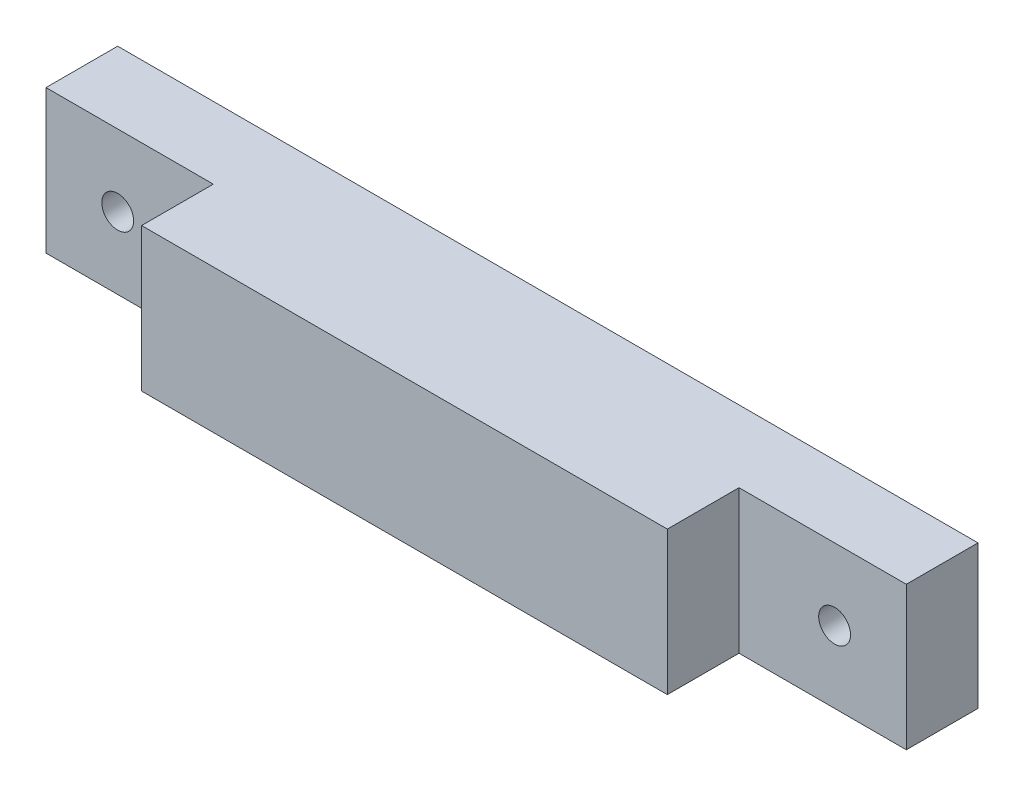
from build123d import *

# Parameters (mm, degrees)
ESQUISSE1_W             = 54
ESQUISSE1_H             = 9
EXTRUSION1_DEPTH        = 9
ESQUISSE3_W             = 10.5
ESQUISSE3_H             = 9
ENL_V_MAT_EXTRU_1_DEPTH = 4.5
ESQUISSE5_W             = 10.5
ESQUISSE5_H             = 9
ENL_V_MAT_EXTRU_2_DEPTH = 4.5
ESQUISSE6_R             = 1
ENL_V_MAT_EXTRU_4_DEPTH = 4.5
ESQUISSE7_R             = 1
ENL_V_MAT_EXTRU_5_DEPTH = 4.5


with BuildPart() as part:
    # Esquisse1 → Extrusion1 (new body)
    with BuildSketch(Plane.XY):
        with Locations((27, 4.5)):
            Rectangle(ESQUISSE1_W, ESQUISSE1_H)
    extrude(amount=EXTRUSION1_DEPTH)

    # Esquisse3 → Enl_v. mat.-Extru.1 (cut)
    with BuildSketch(Plane.XY.offset(9)):
        with Locations((5.25, 4.5)):
            Rectangle(ESQUISSE3_W, ESQUISSE3_H)
    extrude(amount=-ENL_V_MAT_EXTRU_1_DEPTH, mode=Mode.SUBTRACT)

    # Esquisse5 → Enl_v. mat.-Extru.2 (cut)
    with BuildSketch(Plane.XY.offset(9)):
        with Locations((48.75, 4.5)):
            Rectangle(ESQUISSE5_W, ESQUISSE5_H)
    extrude(amount=-ENL_V_MAT_EXTRU_2_DEPTH, mode=Mode.SUBTRACT)

    # Esquisse6 → Enl_v. mat.-Extru.4 (cut)
    with BuildSketch(Plane.XY.offset(4.5)):
        with Locations((4.5, 4.5)):
            Circle(ESQUISSE6_R)
    extrude(amount=-ENL_V_MAT_EXTRU_4_DEPTH, mode=Mode.SUBTRACT)

    # Esquisse7 → Enl_v. mat.-Extru.5 (cut)
    with BuildSketch(Plane.XY.offset(4.5)):
        with Locations((49.5, 4.5)):
            Circle(ESQUISSE7_R)
    extrude(amount=-ENL_V_MAT_EXTRU_5_DEPTH, mode=Mode.SUBTRACT)


solid = part.part
